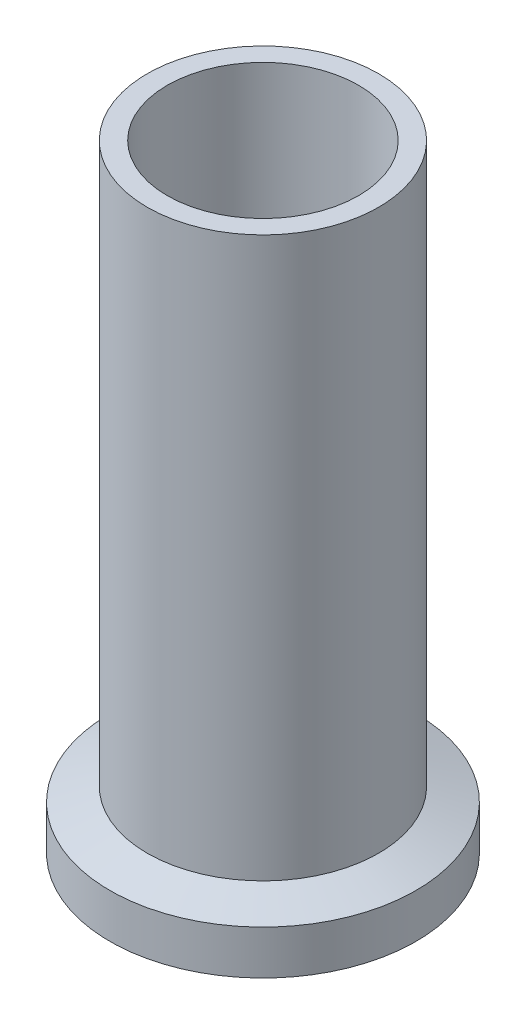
ISO-10303-21;
HEADER;
FILE_DESCRIPTION(('STEP AP214'),'2;1');
FILE_NAME('part.step','',(''),(''),'','','');
FILE_SCHEMA(('AUTOMOTIVE_DESIGN { 1 0 10303 214 1 1 1 1 }'));
ENDSEC;
DATA;
#1=APPLICATION_CONTEXT('core data for automotive mechanical design processes');
#2=APPLICATION_PROTOCOL_DEFINITION('international standard','automotive_design',2000,#1);
#3=PRODUCT_CONTEXT('',#1,'mechanical');
#4=PRODUCT('Part','Part','',(#3));
#5=PRODUCT_RELATED_PRODUCT_CATEGORY('part','',(#4));
#6=PRODUCT_DEFINITION_FORMATION('','',#4);
#7=PRODUCT_DEFINITION_CONTEXT('part definition',#1,'design');
#8=PRODUCT_DEFINITION('design','',#6,#7);
#9=PRODUCT_DEFINITION_SHAPE('','',#8);
#10=(LENGTH_UNIT() NAMED_UNIT(*) SI_UNIT(.MILLI.,.METRE.));
#11=(NAMED_UNIT(*) PLANE_ANGLE_UNIT() SI_UNIT($,.RADIAN.));
#12=(NAMED_UNIT(*) SI_UNIT($,.STERADIAN.) SOLID_ANGLE_UNIT());
#13=UNCERTAINTY_MEASURE_WITH_UNIT(LENGTH_MEASURE(1.E-05),#10,'distance_accuracy_value','');
#14=(GEOMETRIC_REPRESENTATION_CONTEXT(3) GLOBAL_UNCERTAINTY_ASSIGNED_CONTEXT((#13)) GLOBAL_UNIT_ASSIGNED_CONTEXT((#10,
#11,#12)) REPRESENTATION_CONTEXT('',''));
#15=CARTESIAN_POINT('',(0.,0.,0.));
#16=DIRECTION('',(0.,0.,1.));
#17=DIRECTION('',(1.,0.,0.));
#18=AXIS2_PLACEMENT_3D('',#15,#16,#17);
#19=CARTESIAN_POINT('',(0.,0.,0.));
#20=DIRECTION('',(0.,-1.,0.));
#21=DIRECTION('',(0.,0.,-1.));
#22=AXIS2_PLACEMENT_3D('',#19,#20,#21);
#23=CYLINDRICAL_SURFACE('',#22,10.922);
#24=CARTESIAN_POINT('',(0.,1.32079999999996,0.));
#25=DIRECTION('',(0.,-1.,0.));
#26=DIRECTION('',(0.,0.,-1.));
#27=AXIS2_PLACEMENT_3D('',#24,#25,#26);
#28=CIRCLE('',#27,10.922);
#29=CARTESIAN_POINT('',(0.,1.32079999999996,-10.922));
#30=VERTEX_POINT('',#29);
#31=EDGE_CURVE('E12',#30,#30,#28,.T.);
#32=ORIENTED_EDGE('',*,*,#31,.F.);
#33=EDGE_LOOP('',(#32));
#34=FACE_BOUND('',#33,.T.);
#35=CARTESIAN_POINT('',(0.,0.,0.));
#36=DIRECTION('',(0.,-1.,0.));
#37=DIRECTION('',(0.,0.,-1.));
#38=AXIS2_PLACEMENT_3D('',#35,#36,#37);
#39=CIRCLE('',#38,10.922);
#40=CARTESIAN_POINT('',(0.,0.,-10.922));
#41=VERTEX_POINT('',#40);
#42=EDGE_CURVE('E73',#41,#41,#39,.T.);
#43=ORIENTED_EDGE('',*,*,#42,.T.);
#44=EDGE_LOOP('',(#43));
#45=FACE_BOUND('',#44,.T.);
#46=ADVANCED_FACE('F39',(#34,#45),#23,.F.);
#47=CARTESIAN_POINT('',(0.,1.32080000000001,0.));
#48=DIRECTION('',(0.,-1.,0.));
#49=DIRECTION('',(0.,0.,-1.));
#50=AXIS2_PLACEMENT_3D('',#47,#48,#49);
#51=TOROIDAL_SURFACE('',#50,10.1473,0.7747);
#52=CARTESIAN_POINT('',(0.,1.85299891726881,0.));
#53=DIRECTION('',(0.,-1.,0.));
#54=DIRECTION('',(0.,0.,-1.));
#55=AXIS2_PLACEMENT_3D('',#52,#53,#54);
#56=CIRCLE('',#55,9.58433960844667);
#57=CARTESIAN_POINT('',(0.,1.85299891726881,-9.58433960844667));
#58=VERTEX_POINT('',#57);
#59=EDGE_CURVE('E45',#58,#58,#56,.T.);
#60=ORIENTED_EDGE('',*,*,#59,.F.);
#61=EDGE_LOOP('',(#60));
#62=FACE_BOUND('',#61,.T.);
#63=ORIENTED_EDGE('',*,*,#31,.T.);
#64=EDGE_LOOP('',(#63));
#65=FACE_BOUND('',#64,.T.);
#66=ADVANCED_FACE('F122',(#62,#65),#51,.F.);
#67=CARTESIAN_POINT('',(0.,1.85299891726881,0.));
#68=DIRECTION('',(0.,1.,0.));
#69=DIRECTION('',(0.,0.,1.));
#70=AXIS2_PLACEMENT_3D('',#67,#68,#69);
#71=CONICAL_SURFACE('',#70,9.58433960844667,0.794623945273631);
#72=CARTESIAN_POINT('',(0.,0.888999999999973,0.));
#73=DIRECTION('',(0.,-1.,0.));
#74=DIRECTION('',(0.,0.,-1.));
#75=AXIS2_PLACEMENT_3D('',#72,#73,#74);
#76=CIRCLE('',#75,8.60238725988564);
#77=CARTESIAN_POINT('',(0.,0.888999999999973,-8.60238725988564));
#78=VERTEX_POINT('',#77);
#79=EDGE_CURVE('E49',#78,#78,#76,.T.);
#80=ORIENTED_EDGE('',*,*,#79,.F.);
#81=EDGE_LOOP('',(#80));
#82=FACE_BOUND('',#81,.T.);
#83=ORIENTED_EDGE('',*,*,#59,.T.);
#84=EDGE_LOOP('',(#83));
#85=FACE_BOUND('',#84,.T.);
#86=ADVANCED_FACE('F117',(#82,#85),#71,.T.);
#87=CARTESIAN_POINT('',(-8.60238725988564,0.888999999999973,0.));
#88=DIRECTION('',(0.,1.,0.));
#89=DIRECTION('',(0.,0.,1.));
#90=AXIS2_PLACEMENT_3D('',#87,#88,#89);
#91=PLANE('',#90);
#92=CARTESIAN_POINT('',(0.,0.888999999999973,0.));
#93=DIRECTION('',(0.,-1.,0.));
#94=DIRECTION('',(0.,0.,-1.));
#95=AXIS2_PLACEMENT_3D('',#92,#93,#94);
#96=CIRCLE('',#95,7.874);
#97=CARTESIAN_POINT('',(0.,0.888999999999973,-7.874));
#98=VERTEX_POINT('',#97);
#99=EDGE_CURVE('E53',#98,#98,#96,.T.);
#100=ORIENTED_EDGE('',*,*,#99,.F.);
#101=EDGE_LOOP('',(#100));
#102=FACE_BOUND('',#101,.T.);
#103=ORIENTED_EDGE('',*,*,#79,.T.);
#104=EDGE_LOOP('',(#103));
#105=FACE_BOUND('',#104,.T.);
#106=ADVANCED_FACE('F111',(#102,#105),#91,.F.);
#107=CARTESIAN_POINT('',(0.,0.,0.));
#108=DIRECTION('',(0.,-1.,0.));
#109=DIRECTION('',(0.,0.,-1.));
#110=AXIS2_PLACEMENT_3D('',#107,#108,#109);
#111=CYLINDRICAL_SURFACE('',#110,7.874);
#112=CARTESIAN_POINT('',(0.,50.8,0.));
#113=DIRECTION('',(0.,-1.,0.));
#114=DIRECTION('',(0.,0.,-1.));
#115=AXIS2_PLACEMENT_3D('',#112,#113,#114);
#116=CIRCLE('',#115,7.874);
#117=CARTESIAN_POINT('',(0.,50.8,-7.874));
#118=VERTEX_POINT('',#117);
#119=EDGE_CURVE('E58',#118,#118,#116,.T.);
#120=ORIENTED_EDGE('',*,*,#119,.F.);
#121=EDGE_LOOP('',(#120));
#122=FACE_BOUND('',#121,.T.);
#123=ORIENTED_EDGE('',*,*,#99,.T.);
#124=EDGE_LOOP('',(#123));
#125=FACE_BOUND('',#124,.T.);
#126=ADVANCED_FACE('F105',(#122,#125),#111,.F.);
#127=CARTESIAN_POINT('',(-7.874,50.8,0.));
#128=DIRECTION('',(0.,-1.,0.));
#129=DIRECTION('',(0.,0.,-1.));
#130=AXIS2_PLACEMENT_3D('',#127,#128,#129);
#131=PLANE('',#130);
#132=CARTESIAN_POINT('',(0.,50.8,0.));
#133=DIRECTION('',(0.,-1.,0.));
#134=DIRECTION('',(0.,0.,-1.));
#135=AXIS2_PLACEMENT_3D('',#132,#133,#134);
#136=CIRCLE('',#135,9.52500000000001);
#137=CARTESIAN_POINT('',(0.,50.8,-9.52500000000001));
#138=VERTEX_POINT('',#137);
#139=EDGE_CURVE('E61',#138,#138,#136,.T.);
#140=ORIENTED_EDGE('',*,*,#139,.F.);
#141=EDGE_LOOP('',(#140));
#142=FACE_BOUND('',#141,.T.);
#143=ORIENTED_EDGE('',*,*,#119,.T.);
#144=EDGE_LOOP('',(#143));
#145=FACE_BOUND('',#144,.T.);
#146=ADVANCED_FACE('F99',(#142,#145),#131,.F.);
#147=CARTESIAN_POINT('',(0.,0.,0.));
#148=DIRECTION('',(0.,-1.,0.));
#149=DIRECTION('',(0.,0.,-1.));
#150=AXIS2_PLACEMENT_3D('',#147,#148,#149);
#151=CYLINDRICAL_SURFACE('',#150,9.52500000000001);
#152=CARTESIAN_POINT('',(0.,4.75082611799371,0.));
#153=DIRECTION('',(0.,-1.,0.));
#154=DIRECTION('',(0.,0.,-1.));
#155=AXIS2_PLACEMENT_3D('',#152,#153,#154);
#156=CIRCLE('',#155,9.525);
#157=CARTESIAN_POINT('',(0.,4.75082611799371,-9.525));
#158=VERTEX_POINT('',#157);
#159=EDGE_CURVE('E64',#158,#158,#156,.T.);
#160=ORIENTED_EDGE('',*,*,#159,.F.);
#161=EDGE_LOOP('',(#160));
#162=FACE_BOUND('',#161,.T.);
#163=ORIENTED_EDGE('',*,*,#139,.T.);
#164=EDGE_LOOP('',(#163));
#165=FACE_BOUND('',#164,.T.);
#166=ADVANCED_FACE('F93',(#162,#165),#151,.T.);
#167=CARTESIAN_POINT('',(0.,4.75082611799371,0.));
#168=DIRECTION('',(0.,-1.,0.));
#169=DIRECTION('',(0.,0.,-1.));
#170=AXIS2_PLACEMENT_3D('',#167,#168,#169);
#171=CONICAL_SURFACE('',#170,9.525,1.22173047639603);
#172=CARTESIAN_POINT('',(0.,3.63219999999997,0.));
#173=DIRECTION('',(0.,-1.,0.));
#174=DIRECTION('',(0.,0.,-1.));
#175=AXIS2_PLACEMENT_3D('',#172,#173,#174);
#176=CIRCLE('',#175,12.5984);
#177=CARTESIAN_POINT('',(0.,3.63219999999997,-12.5984));
#178=VERTEX_POINT('',#177);
#179=EDGE_CURVE('E67',#178,#178,#176,.T.);
#180=ORIENTED_EDGE('',*,*,#179,.F.);
#181=EDGE_LOOP('',(#180));
#182=FACE_BOUND('',#181,.T.);
#183=ORIENTED_EDGE('',*,*,#159,.T.);
#184=EDGE_LOOP('',(#183));
#185=FACE_BOUND('',#184,.T.);
#186=ADVANCED_FACE('F87',(#182,#185),#171,.T.);
#187=CARTESIAN_POINT('',(0.,0.,0.));
#188=DIRECTION('',(0.,-1.,0.));
#189=DIRECTION('',(0.,0.,-1.));
#190=AXIS2_PLACEMENT_3D('',#187,#188,#189);
#191=CYLINDRICAL_SURFACE('',#190,12.5984);
#192=CARTESIAN_POINT('',(0.,0.,0.));
#193=DIRECTION('',(0.,-1.,0.));
#194=DIRECTION('',(0.,0.,-1.));
#195=AXIS2_PLACEMENT_3D('',#192,#193,#194);
#196=CIRCLE('',#195,12.5984);
#197=CARTESIAN_POINT('',(0.,0.,-12.5984));
#198=VERTEX_POINT('',#197);
#199=EDGE_CURVE('E70',#198,#198,#196,.T.);
#200=ORIENTED_EDGE('',*,*,#199,.F.);
#201=EDGE_LOOP('',(#200));
#202=FACE_BOUND('',#201,.T.);
#203=ORIENTED_EDGE('',*,*,#179,.T.);
#204=EDGE_LOOP('',(#203));
#205=FACE_BOUND('',#204,.T.);
#206=ADVANCED_FACE('F81',(#202,#205),#191,.T.);
#207=CARTESIAN_POINT('',(-12.5984,0.,0.));
#208=DIRECTION('',(0.,1.,0.));
#209=DIRECTION('',(0.,0.,1.));
#210=AXIS2_PLACEMENT_3D('',#207,#208,#209);
#211=PLANE('',#210);
#212=ORIENTED_EDGE('',*,*,#42,.F.);
#213=EDGE_LOOP('',(#212));
#214=FACE_BOUND('',#213,.T.);
#215=ORIENTED_EDGE('',*,*,#199,.T.);
#216=EDGE_LOOP('',(#215));
#217=FACE_BOUND('',#216,.T.);
#218=ADVANCED_FACE('F78',(#214,#217),#211,.F.);
#219=CLOSED_SHELL('',(#46,#66,#86,#106,#126,#146,#166,#186,#206,#218));
#220=MANIFOLD_SOLID_BREP('B2',#219);
#221=ADVANCED_BREP_SHAPE_REPRESENTATION('',(#18,#220),#14);
#222=SHAPE_DEFINITION_REPRESENTATION(#9,#221);
ENDSEC;
END-ISO-10303-21;
